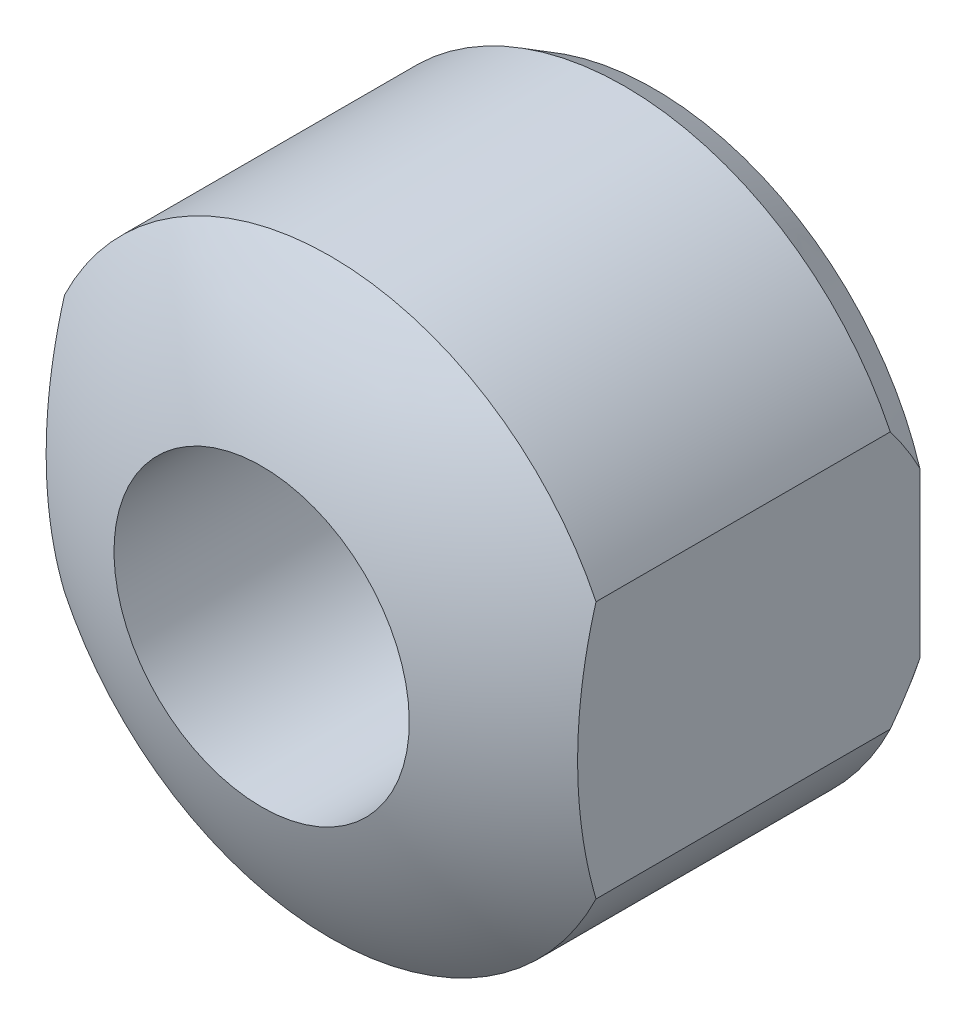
ISO-10303-21;
HEADER;
FILE_DESCRIPTION(('STEP AP214'),'2;1');
FILE_NAME('part.step','',(''),(''),'','','');
FILE_SCHEMA(('AUTOMOTIVE_DESIGN { 1 0 10303 214 1 1 1 1 }'));
ENDSEC;
DATA;
#1=APPLICATION_CONTEXT('core data for automotive mechanical design processes');
#2=APPLICATION_PROTOCOL_DEFINITION('international standard','automotive_design',2000,#1);
#3=PRODUCT_CONTEXT('',#1,'mechanical');
#4=PRODUCT('Part','Part','',(#3));
#5=PRODUCT_RELATED_PRODUCT_CATEGORY('part','',(#4));
#6=PRODUCT_DEFINITION_FORMATION('','',#4);
#7=PRODUCT_DEFINITION_CONTEXT('part definition',#1,'design');
#8=PRODUCT_DEFINITION('design','',#6,#7);
#9=PRODUCT_DEFINITION_SHAPE('','',#8);
#10=(LENGTH_UNIT() NAMED_UNIT(*) SI_UNIT(.MILLI.,.METRE.));
#11=(NAMED_UNIT(*) PLANE_ANGLE_UNIT() SI_UNIT($,.RADIAN.));
#12=(NAMED_UNIT(*) SI_UNIT($,.STERADIAN.) SOLID_ANGLE_UNIT());
#13=UNCERTAINTY_MEASURE_WITH_UNIT(LENGTH_MEASURE(1.E-05),#10,'distance_accuracy_value','');
#14=(GEOMETRIC_REPRESENTATION_CONTEXT(3) GLOBAL_UNCERTAINTY_ASSIGNED_CONTEXT((#13)) GLOBAL_UNIT_ASSIGNED_CONTEXT((#10,
#11,#12)) REPRESENTATION_CONTEXT('',''));
#15=CARTESIAN_POINT('',(0.,0.,0.));
#16=DIRECTION('',(0.,0.,1.));
#17=DIRECTION('',(1.,0.,0.));
#18=AXIS2_PLACEMENT_3D('',#15,#16,#17);
#19=CARTESIAN_POINT('',(4.6750797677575E-13,0.,-2.00000000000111));
#20=DIRECTION('',(0.,0.,1.));
#21=DIRECTION('',(-1.,0.,0.));
#22=AXIS2_PLACEMENT_3D('',#19,#20,#21);
#23=SPHERICAL_SURFACE('',#22,9.0000000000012);
#24=CARTESIAN_POINT('',(4.5,0.,-2.00000000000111));
#25=DIRECTION('',(-1.,0.,0.));
#26=DIRECTION('',(0.,-1.,0.));
#27=AXIS2_PLACEMENT_3D('',#24,#25,#26);
#28=CIRCLE('',#27,7.7942286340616);
#29=CARTESIAN_POINT('',(4.5,2.17944947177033,5.4833147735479));
#30=VERTEX_POINT('',#29);
#31=CARTESIAN_POINT('',(4.5,-2.17944947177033,5.4833147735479));
#32=VERTEX_POINT('',#31);
#33=EDGE_CURVE('E109',#30,#32,#28,.F.);
#34=ORIENTED_EDGE('',*,*,#33,.F.);
#35=CARTESIAN_POINT('',(0.,0.,5.4833147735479));
#36=DIRECTION('',(0.,0.,1.));
#37=DIRECTION('',(0.,1.,0.));
#38=AXIS2_PLACEMENT_3D('',#35,#36,#37);
#39=CIRCLE('',#38,5.);
#40=CARTESIAN_POINT('',(-4.5,2.17944947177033,5.4833147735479));
#41=VERTEX_POINT('',#40);
#42=EDGE_CURVE('E21',#30,#41,#39,.T.);
#43=ORIENTED_EDGE('',*,*,#42,.T.);
#44=CARTESIAN_POINT('',(-4.5,0.,-2.00000000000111));
#45=DIRECTION('',(1.,0.,0.));
#46=DIRECTION('',(0.,1.,0.));
#47=AXIS2_PLACEMENT_3D('',#44,#45,#46);
#48=CIRCLE('',#47,7.79422863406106);
#49=CARTESIAN_POINT('',(-4.5,-2.17944947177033,5.4833147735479));
#50=VERTEX_POINT('',#49);
#51=EDGE_CURVE('E91',#50,#41,#48,.F.);
#52=ORIENTED_EDGE('',*,*,#51,.F.);
#53=EDGE_CURVE('E9',#50,#32,#39,.T.);
#54=ORIENTED_EDGE('',*,*,#53,.T.);
#55=EDGE_LOOP('',(#34,#43,#52,#54));
#56=FACE_BOUND('',#55,.T.);
#57=CARTESIAN_POINT('',(0.,0.,6.64580823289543));
#58=DIRECTION('',(0.,0.,-1.));
#59=DIRECTION('',(0.,-1.,0.));
#60=AXIS2_PLACEMENT_3D('',#57,#58,#59);
#61=CIRCLE('',#60,2.5);
#62=CARTESIAN_POINT('',(0.,-2.5,6.64580823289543));
#63=VERTEX_POINT('',#62);
#64=EDGE_CURVE('E85',#63,#63,#61,.T.);
#65=ORIENTED_EDGE('',*,*,#64,.T.);
#66=EDGE_LOOP('',(#65));
#67=FACE_BOUND('',#66,.T.);
#68=ADVANCED_FACE('F14',(#56,#67),#23,.T.);
#69=CARTESIAN_POINT('',(0.,0.,0.));
#70=DIRECTION('',(0.,0.,1.));
#71=DIRECTION('',(0.,1.,0.));
#72=AXIS2_PLACEMENT_3D('',#69,#70,#71);
#73=CYLINDRICAL_SURFACE('',#72,5.);
#74=ORIENTED_EDGE('',*,*,#42,.F.);
#75=DIRECTION('',(0.,0.,1.));
#76=VECTOR('',#75,1.);
#77=CARTESIAN_POINT('',(4.5,2.17944947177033,0.));
#78=LINE('',#77,#76);
#79=CARTESIAN_POINT('',(4.5,2.17944947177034,0.5));
#80=VERTEX_POINT('',#79);
#81=EDGE_CURVE('E76',#30,#80,#78,.F.);
#82=ORIENTED_EDGE('',*,*,#81,.T.);
#83=CARTESIAN_POINT('',(0.,0.,0.5));
#84=DIRECTION('',(0.,0.,1.));
#85=DIRECTION('',(0.,1.,0.));
#86=AXIS2_PLACEMENT_3D('',#83,#84,#85);
#87=CIRCLE('',#86,5.);
#88=CARTESIAN_POINT('',(-4.5,2.17944947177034,0.5));
#89=VERTEX_POINT('',#88);
#90=EDGE_CURVE('E84',#80,#89,#87,.T.);
#91=ORIENTED_EDGE('',*,*,#90,.T.);
#92=DIRECTION('',(0.,0.,1.));
#93=VECTOR('',#92,1.);
#94=CARTESIAN_POINT('',(-4.5,2.17944947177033,0.));
#95=LINE('',#94,#93);
#96=EDGE_CURVE('E105',#89,#41,#95,.T.);
#97=ORIENTED_EDGE('',*,*,#96,.T.);
#98=EDGE_LOOP('',(#74,#82,#91,#97));
#99=FACE_BOUND('',#98,.T.);
#100=ADVANCED_FACE('F104',(#99),#73,.T.);
#101=CARTESIAN_POINT('',(0.,0.,0.5));
#102=DIRECTION('',(0.,0.,1.));
#103=DIRECTION('',(0.,1.,0.));
#104=AXIS2_PLACEMENT_3D('',#101,#102,#103);
#105=CONICAL_SURFACE('',#104,5.,0.523598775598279);
#106=ORIENTED_EDGE('',*,*,#90,.F.);
#107=CARTESIAN_POINT('',(4.5,5.0188098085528,3.5151626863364));
#108=CARTESIAN_POINT('',(4.5,4.90794191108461,3.37222700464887));
#109=CARTESIAN_POINT('',(4.5,4.79608084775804,3.23004881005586));
#110=CARTESIAN_POINT('',(4.5,4.56991738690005,2.94757122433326));
#111=CARTESIAN_POINT('',(4.5,4.45561418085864,2.80727248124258));
#112=CARTESIAN_POINT('',(4.5,4.22260911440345,2.52711902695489));
#113=CARTESIAN_POINT('',(4.5,4.10386854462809,2.38729640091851));
#114=CARTESIAN_POINT('',(4.5,3.86293020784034,2.11068843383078));
#115=CARTESIAN_POINT('',(4.5,3.74073294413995,1.97390265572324));
#116=CARTESIAN_POINT('',(4.5,3.48308543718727,1.6943486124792));
#117=CARTESIAN_POINT('',(4.5,3.34731834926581,1.55187082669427));
#118=CARTESIAN_POINT('',(4.5,3.06974114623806,1.27274992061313));
#119=CARTESIAN_POINT('',(4.5,2.92792833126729,1.13610946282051));
#120=CARTESIAN_POINT('',(4.5,2.63769738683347,0.871736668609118));
#121=CARTESIAN_POINT('',(4.5,2.48932292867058,0.743956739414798));
#122=CARTESIAN_POINT('',(4.5,2.18349580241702,0.499865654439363));
#123=CARTESIAN_POINT('',(4.5,2.02605405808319,0.383541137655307));
#124=CARTESIAN_POINT('',(4.5,1.78663625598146,0.22493208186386));
#125=CARTESIAN_POINT('',(4.5,1.70897444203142,0.176128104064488));
#126=CARTESIAN_POINT('',(4.5,1.55098989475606,0.0829326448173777));
#127=CARTESIAN_POINT('',(4.5,1.47066620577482,0.0385427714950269));
#128=CARTESIAN_POINT('',(4.5,1.30784299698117,-0.0446296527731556));
#129=CARTESIAN_POINT('',(4.5,1.22536247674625,-0.0834490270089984));
#130=CARTESIAN_POINT('',(4.5,1.05776162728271,-0.154833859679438));
#131=CARTESIAN_POINT('',(4.5,0.972641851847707,-0.187400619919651));
#132=CARTESIAN_POINT('',(4.5,0.739201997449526,-0.265504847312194));
#133=CARTESIAN_POINT('',(4.5,0.588437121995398,-0.304113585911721));
#134=CARTESIAN_POINT('',(4.5,0.282539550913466,-0.355110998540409));
#135=CARTESIAN_POINT('',(4.5,0.127411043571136,-0.367524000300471));
#136=CARTESIAN_POINT('',(4.5,-0.182772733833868,-0.364231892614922));
#137=CARTESIAN_POINT('',(4.5,-0.337827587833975,-0.348486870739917));
#138=CARTESIAN_POINT('',(4.5,-0.643120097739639,-0.291243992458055));
#139=CARTESIAN_POINT('',(4.5,-0.793349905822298,-0.249706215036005));
#140=CARTESIAN_POINT('',(4.5,-1.15880598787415,-0.12033487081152));
#141=CARTESIAN_POINT('',(4.5,-1.36945500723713,-0.0197663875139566));
#142=CARTESIAN_POINT('',(4.5,-1.67256417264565,0.153280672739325));
#143=CARTESIAN_POINT('',(4.5,-1.77173834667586,0.21488362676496));
#144=CARTESIAN_POINT('',(4.5,-1.96614271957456,0.344041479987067));
#145=CARTESIAN_POINT('',(4.5,-2.06137380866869,0.411595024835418));
#146=CARTESIAN_POINT('',(4.5,-2.30741799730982,0.595629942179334));
#147=CARTESIAN_POINT('',(4.5,-2.45528404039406,0.716030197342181));
#148=CARTESIAN_POINT('',(4.5,-2.67036058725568,0.902373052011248));
#149=CARTESIAN_POINT('',(4.5,-2.74049583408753,0.965017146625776));
#150=CARTESIAN_POINT('',(4.5,-2.87905632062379,1.0921269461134));
#151=CARTESIAN_POINT('',(4.5,-2.94748210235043,1.15659205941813));
#152=CARTESIAN_POINT('',(4.5,-3.01516268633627,1.22183624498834));
#153=B_SPLINE_CURVE_WITH_KNOTS('',3,(#107,#108,#109,#110,#111,#112,#113,#114,#115,#116,#117,
#118,#119,#120,#121,#122,#123,#124,#125,#126,#127,#128,#129,#130,#131,#132,#133,#134,#135,#136,
#137,#138,#139,#140,#141,#142,#143,#144,#145,#146,#147,#148,#149,#150,#151,#152),.UNSPECIFIED.,
.F.,.F.,(4,2,2,2,2,2,2,2,2,2,2,2,2,2,2,2,2,2,2,2,2,2,4),(0.,0.542689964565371,1.08556246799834,
1.63583034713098,2.1860185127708,2.7763022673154,3.36685244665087,3.95393526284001,
4.54032501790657,4.81537958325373,5.09053399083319,5.36377626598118,5.6369615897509,
6.10179897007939,6.56620447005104,7.03126876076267,7.49705466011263,8.19307286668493,
8.54321858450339,8.89328481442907,9.46479429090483,9.74688878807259,10.0288926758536),.UNSPECIFIED.);
#154=CARTESIAN_POINT('',(4.5,1.39519962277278,0.));
#155=VERTEX_POINT('',#154);
#156=EDGE_CURVE('E68',#80,#155,#153,.T.);
#157=ORIENTED_EDGE('',*,*,#156,.T.);
#158=CARTESIAN_POINT('',(0.,0.,0.));
#159=DIRECTION('',(0.,0.,1.));
#160=DIRECTION('',(0.,1.,0.));
#161=AXIS2_PLACEMENT_3D('',#158,#159,#160);
#162=CIRCLE('',#161,4.7113248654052);
#163=CARTESIAN_POINT('',(-4.5,1.39519962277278,0.));
#164=VERTEX_POINT('',#163);
#165=EDGE_CURVE('E82',#155,#164,#162,.T.);
#166=ORIENTED_EDGE('',*,*,#165,.T.);
#167=CARTESIAN_POINT('',(-4.5,-3.01516268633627,1.22183624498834));
#168=CARTESIAN_POINT('',(-4.5,-2.95586660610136,1.16467332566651));
#169=CARTESIAN_POINT('',(-4.5,-2.89599591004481,1.10810789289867));
#170=CARTESIAN_POINT('',(-4.5,-2.77496213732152,0.996347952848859));
#171=CARTESIAN_POINT('',(-4.5,-2.7137987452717,0.941153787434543));
#172=CARTESIAN_POINT('',(-4.5,-2.52757348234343,0.777384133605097));
#173=CARTESIAN_POINT('',(-4.5,-2.40037352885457,0.671203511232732));
#174=CARTESIAN_POINT('',(-4.5,-2.13536694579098,0.464484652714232));
#175=CARTESIAN_POINT('',(-4.5,-1.9973588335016,0.364202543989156));
#176=CARTESIAN_POINT('',(-4.5,-1.71305567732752,0.176532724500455));
#177=CARTESIAN_POINT('',(-4.5,-1.56677990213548,0.0891166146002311));
#178=CARTESIAN_POINT('',(-4.5,-1.34171213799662,-0.0278732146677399));
#179=CARTESIAN_POINT('',(-4.5,-1.2664453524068,-0.0642495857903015));
#180=CARTESIAN_POINT('',(-4.5,-1.11363024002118,-0.131920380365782));
#181=CARTESIAN_POINT('',(-4.5,-1.03608171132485,-0.163214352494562));
#182=CARTESIAN_POINT('',(-4.5,-0.879373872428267,-0.219699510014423));
#183=CARTESIAN_POINT('',(-4.5,-0.800229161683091,-0.244930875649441));
#184=CARTESIAN_POINT('',(-4.5,-0.640126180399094,-0.288751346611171));
#185=CARTESIAN_POINT('',(-4.5,-0.559168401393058,-0.307342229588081));
#186=CARTESIAN_POINT('',(-4.5,-0.394736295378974,-0.337394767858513));
#187=CARTESIAN_POINT('',(-4.5,-0.311242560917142,-0.348751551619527));
#188=CARTESIAN_POINT('',(-4.5,-0.143547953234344,-0.363409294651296));
#189=CARTESIAN_POINT('',(-4.5,-0.0593471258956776,-0.366710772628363));
#190=CARTESIAN_POINT('',(-4.5,0.109037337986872,-0.365102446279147));
#191=CARTESIAN_POINT('',(-4.5,0.193220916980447,-0.360186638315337));
#192=CARTESIAN_POINT('',(-4.5,0.36073493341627,-0.342363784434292));
#193=CARTESIAN_POINT('',(-4.5,0.444065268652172,-0.329455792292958));
#194=CARTESIAN_POINT('',(-4.5,0.618485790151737,-0.294339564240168));
#195=CARTESIAN_POINT('',(-4.5,0.709397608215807,-0.271250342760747));
#196=CARTESIAN_POINT('',(-4.5,0.888766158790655,-0.216936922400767));
#197=CARTESIAN_POINT('',(-4.5,0.977221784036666,-0.185709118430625));
#198=CARTESIAN_POINT('',(-4.5,1.15154953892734,-0.116215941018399));
#199=CARTESIAN_POINT('',(-4.5,1.23741474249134,-0.077933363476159));
#200=CARTESIAN_POINT('',(-4.5,1.40625691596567,0.0044865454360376));
#201=CARTESIAN_POINT('',(-4.5,1.48923397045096,0.0486237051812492));
#202=CARTESIAN_POINT('',(-4.5,1.66628172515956,0.149685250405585));
#203=CARTESIAN_POINT('',(-4.5,1.75983754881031,0.207507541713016));
#204=CARTESIAN_POINT('',(-4.5,1.94342924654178,0.328512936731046));
#205=CARTESIAN_POINT('',(-4.5,2.03346377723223,0.391698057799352));
#206=CARTESIAN_POINT('',(-4.5,2.29904677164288,0.587860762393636));
#207=CARTESIAN_POINT('',(-4.5,2.46982294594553,0.727295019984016));
#208=CARTESIAN_POINT('',(-4.5,2.80246842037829,1.01849615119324));
#209=CARTESIAN_POINT('',(-4.5,2.96426414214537,1.17034513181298));
#210=CARTESIAN_POINT('',(-4.5,3.27980281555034,1.48189346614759));
#211=CARTESIAN_POINT('',(-4.5,3.43355209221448,1.64158645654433));
#212=CARTESIAN_POINT('',(-4.5,3.71188510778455,1.94194570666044));
#213=CARTESIAN_POINT('',(-4.5,3.8373453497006,2.08180703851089));
#214=CARTESIAN_POINT('',(-4.5,4.08460412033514,2.36477062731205));
#215=CARTESIAN_POINT('',(-4.5,4.20640193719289,2.50787350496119));
#216=CARTESIAN_POINT('',(-4.5,4.44470162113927,2.79393957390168));
#217=CARTESIAN_POINT('',(-4.5,4.56125983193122,2.93685601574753));
#218=CARTESIAN_POINT('',(-4.5,4.79182460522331,3.22464127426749));
#219=CARTESIAN_POINT('',(-4.5,4.90583216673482,3.36950928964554));
#220=CARTESIAN_POINT('',(-4.5,5.01880980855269,3.51516268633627));
#221=B_SPLINE_CURVE_WITH_KNOTS('',3,(#167,#168,#169,#170,#171,#172,#173,#174,#175,#176,#177,
#178,#179,#180,#181,#182,#183,#184,#185,#186,#187,#188,#189,#190,#191,#192,#193,#194,#195,#196,
#197,#198,#199,#200,#201,#202,#203,#204,#205,#206,#207,#208,#209,#210,#211,#212,#213,#214,#215,
#216,#217,#218,#219,#220),.UNSPECIFIED.,.F.,.F.,(4,2,2,2,2,2,2,2,2,2,2,2,2,2,2,2,2,2,2,2,2,2,2,
2,2,2,4),(0.,0.24707929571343,0.49421958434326,0.990998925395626,1.50231926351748,
2.01249346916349,2.26313207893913,2.51379293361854,2.7627436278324,3.01162762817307,
3.26404213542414,3.51644038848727,3.76902312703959,4.02163577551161,4.30259136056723,
4.58367161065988,4.86544661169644,5.14721335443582,5.47692582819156,5.80676288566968,
6.46731276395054,7.1326532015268,7.79746253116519,8.36105342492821,8.92475316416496,
9.47798553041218,10.030997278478),.UNSPECIFIED.);
#222=EDGE_CURVE('E107',#164,#89,#221,.T.);
#223=ORIENTED_EDGE('',*,*,#222,.T.);
#224=EDGE_LOOP('',(#106,#157,#166,#223));
#225=FACE_BOUND('',#224,.T.);
#226=ADVANCED_FACE('F80',(#225),#105,.T.);
#227=CARTESIAN_POINT('',(-4.7113248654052,0.,0.));
#228=DIRECTION('',(0.,0.,-1.));
#229=DIRECTION('',(0.,-1.,0.));
#230=AXIS2_PLACEMENT_3D('',#227,#228,#229);
#231=PLANE('',#230);
#232=CARTESIAN_POINT('',(0.,0.,0.));
#233=DIRECTION('',(0.,0.,1.));
#234=DIRECTION('',(0.,1.,0.));
#235=AXIS2_PLACEMENT_3D('',#232,#233,#234);
#236=CIRCLE('',#235,2.5);
#237=CARTESIAN_POINT('',(0.,2.5,0.));
#238=VERTEX_POINT('',#237);
#239=EDGE_CURVE('E154',#238,#238,#236,.T.);
#240=ORIENTED_EDGE('',*,*,#239,.T.);
#241=EDGE_LOOP('',(#240));
#242=FACE_BOUND('',#241,.T.);
#243=ORIENTED_EDGE('',*,*,#165,.F.);
#244=DIRECTION('',(0.,1.,0.));
#245=VECTOR('',#244,1.);
#246=CARTESIAN_POINT('',(4.5,-5.,0.));
#247=LINE('',#246,#245);
#248=CARTESIAN_POINT('',(4.5,-1.39519962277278,0.));
#249=VERTEX_POINT('',#248);
#250=EDGE_CURVE('E64',#249,#155,#247,.T.);
#251=ORIENTED_EDGE('',*,*,#250,.F.);
#252=CARTESIAN_POINT('',(-4.5,-1.39519962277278,0.));
#253=VERTEX_POINT('',#252);
#254=EDGE_CURVE('E90',#253,#249,#162,.T.);
#255=ORIENTED_EDGE('',*,*,#254,.F.);
#256=DIRECTION('',(0.,1.,0.));
#257=VECTOR('',#256,1.);
#258=CARTESIAN_POINT('',(-4.5,-5.,0.));
#259=LINE('',#258,#257);
#260=EDGE_CURVE('E88',#253,#164,#259,.T.);
#261=ORIENTED_EDGE('',*,*,#260,.T.);
#262=EDGE_LOOP('',(#243,#251,#255,#261));
#263=FACE_BOUND('',#262,.T.);
#264=ADVANCED_FACE('F87',(#242,#263),#231,.T.);
#265=DIRECTION('',(0.,0.,1.));
#266=VECTOR('',#265,1.);
#267=CARTESIAN_POINT('',(4.5,-2.17944947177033,0.));
#268=LINE('',#267,#266);
#269=CARTESIAN_POINT('',(4.5,-2.17944947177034,0.5));
#270=VERTEX_POINT('',#269);
#271=EDGE_CURVE('E111',#32,#270,#268,.F.);
#272=ORIENTED_EDGE('',*,*,#271,.F.);
#273=ORIENTED_EDGE('',*,*,#53,.F.);
#274=DIRECTION('',(0.,0.,1.));
#275=VECTOR('',#274,1.);
#276=CARTESIAN_POINT('',(-4.5,-2.17944947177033,0.));
#277=LINE('',#276,#275);
#278=CARTESIAN_POINT('',(-4.5,-2.17944947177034,0.5));
#279=VERTEX_POINT('',#278);
#280=EDGE_CURVE('E28',#279,#50,#277,.T.);
#281=ORIENTED_EDGE('',*,*,#280,.F.);
#282=EDGE_CURVE('E95',#279,#270,#87,.T.);
#283=ORIENTED_EDGE('',*,*,#282,.T.);
#284=EDGE_LOOP('',(#272,#273,#281,#283));
#285=FACE_BOUND('',#284,.T.);
#286=ADVANCED_FACE('F137',(#285),#73,.T.);
#287=CARTESIAN_POINT('',(4.5,-5.0188098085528,3.5151626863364));
#288=CARTESIAN_POINT('',(4.5,-4.90794191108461,3.37222700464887));
#289=CARTESIAN_POINT('',(4.5,-4.79608084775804,3.23004881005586));
#290=CARTESIAN_POINT('',(4.5,-4.56991738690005,2.94757122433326));
#291=CARTESIAN_POINT('',(4.5,-4.45561418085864,2.80727248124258));
#292=CARTESIAN_POINT('',(4.5,-4.22260911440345,2.52711902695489));
#293=CARTESIAN_POINT('',(4.5,-4.10386854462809,2.38729640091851));
#294=CARTESIAN_POINT('',(4.5,-3.86293020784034,2.11068843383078));
#295=CARTESIAN_POINT('',(4.5,-3.74073294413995,1.97390265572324));
#296=CARTESIAN_POINT('',(4.5,-3.48308543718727,1.6943486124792));
#297=CARTESIAN_POINT('',(4.5,-3.34731834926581,1.55187082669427));
#298=CARTESIAN_POINT('',(4.5,-3.06974114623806,1.27274992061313));
#299=CARTESIAN_POINT('',(4.5,-2.92792833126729,1.13610946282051));
#300=CARTESIAN_POINT('',(4.5,-2.63769738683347,0.871736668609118));
#301=CARTESIAN_POINT('',(4.5,-2.48932292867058,0.743956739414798));
#302=CARTESIAN_POINT('',(4.5,-2.18349580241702,0.499865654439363));
#303=CARTESIAN_POINT('',(4.5,-2.02605405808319,0.383541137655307));
#304=CARTESIAN_POINT('',(4.5,-1.78663625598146,0.22493208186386));
#305=CARTESIAN_POINT('',(4.5,-1.70897444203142,0.176128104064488));
#306=CARTESIAN_POINT('',(4.5,-1.55098989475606,0.0829326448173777));
#307=CARTESIAN_POINT('',(4.5,-1.47066620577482,0.0385427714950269));
#308=CARTESIAN_POINT('',(4.5,-1.30784299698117,-0.0446296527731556));
#309=CARTESIAN_POINT('',(4.5,-1.22536247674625,-0.0834490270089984));
#310=CARTESIAN_POINT('',(4.5,-1.05776162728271,-0.154833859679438));
#311=CARTESIAN_POINT('',(4.5,-0.972641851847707,-0.187400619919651));
#312=CARTESIAN_POINT('',(4.5,-0.739201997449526,-0.265504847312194));
#313=CARTESIAN_POINT('',(4.5,-0.588437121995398,-0.304113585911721));
#314=CARTESIAN_POINT('',(4.5,-0.282539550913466,-0.355110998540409));
#315=CARTESIAN_POINT('',(4.5,-0.127411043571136,-0.367524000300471));
#316=CARTESIAN_POINT('',(4.5,0.182772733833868,-0.364231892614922));
#317=CARTESIAN_POINT('',(4.5,0.337827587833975,-0.348486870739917));
#318=CARTESIAN_POINT('',(4.5,0.643120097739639,-0.291243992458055));
#319=CARTESIAN_POINT('',(4.5,0.793349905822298,-0.249706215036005));
#320=CARTESIAN_POINT('',(4.5,1.15880598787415,-0.12033487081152));
#321=CARTESIAN_POINT('',(4.5,1.36945500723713,-0.0197663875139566));
#322=CARTESIAN_POINT('',(4.5,1.67256417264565,0.153280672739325));
#323=CARTESIAN_POINT('',(4.5,1.77173834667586,0.21488362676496));
#324=CARTESIAN_POINT('',(4.5,1.96614271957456,0.344041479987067));
#325=CARTESIAN_POINT('',(4.5,2.06137380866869,0.411595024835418));
#326=CARTESIAN_POINT('',(4.5,2.30741799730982,0.595629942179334));
#327=CARTESIAN_POINT('',(4.5,2.45528404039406,0.716030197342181));
#328=CARTESIAN_POINT('',(4.5,2.67036058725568,0.902373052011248));
#329=CARTESIAN_POINT('',(4.5,2.74049583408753,0.965017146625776));
#330=CARTESIAN_POINT('',(4.5,2.87905632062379,1.0921269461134));
#331=CARTESIAN_POINT('',(4.5,2.94748210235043,1.15659205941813));
#332=CARTESIAN_POINT('',(4.5,3.01516268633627,1.22183624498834));
#333=B_SPLINE_CURVE_WITH_KNOTS('',3,(#287,#288,#289,#290,#291,#292,#293,#294,#295,#296,#297,
#298,#299,#300,#301,#302,#303,#304,#305,#306,#307,#308,#309,#310,#311,#312,#313,#314,#315,#316,
#317,#318,#319,#320,#321,#322,#323,#324,#325,#326,#327,#328,#329,#330,#331,#332),.UNSPECIFIED.,
.F.,.F.,(4,2,2,2,2,2,2,2,2,2,2,2,2,2,2,2,2,2,2,2,2,2,4),(0.,0.542689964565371,1.08556246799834,
1.63583034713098,2.1860185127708,2.7763022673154,3.36685244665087,3.95393526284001,
4.54032501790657,4.81537958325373,5.09053399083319,5.36377626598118,5.6369615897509,
6.10179897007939,6.56620447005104,7.03126876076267,7.49705466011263,8.19307286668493,
8.54321858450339,8.89328481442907,9.46479429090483,9.74688878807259,10.0288926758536),.UNSPECIFIED.);
#334=EDGE_CURVE('E71',#270,#249,#333,.T.);
#335=ORIENTED_EDGE('',*,*,#334,.F.);
#336=ORIENTED_EDGE('',*,*,#282,.F.);
#337=CARTESIAN_POINT('',(-4.5,3.01516268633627,1.22183624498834));
#338=CARTESIAN_POINT('',(-4.5,2.95586660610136,1.16467332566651));
#339=CARTESIAN_POINT('',(-4.5,2.89599591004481,1.10810789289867));
#340=CARTESIAN_POINT('',(-4.5,2.77496213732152,0.996347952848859));
#341=CARTESIAN_POINT('',(-4.5,2.7137987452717,0.941153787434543));
#342=CARTESIAN_POINT('',(-4.5,2.52757348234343,0.777384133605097));
#343=CARTESIAN_POINT('',(-4.5,2.40037352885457,0.671203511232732));
#344=CARTESIAN_POINT('',(-4.5,2.13536694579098,0.464484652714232));
#345=CARTESIAN_POINT('',(-4.5,1.9973588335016,0.364202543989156));
#346=CARTESIAN_POINT('',(-4.5,1.71305567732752,0.176532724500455));
#347=CARTESIAN_POINT('',(-4.5,1.56677990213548,0.0891166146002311));
#348=CARTESIAN_POINT('',(-4.5,1.34171213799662,-0.0278732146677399));
#349=CARTESIAN_POINT('',(-4.5,1.2664453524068,-0.0642495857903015));
#350=CARTESIAN_POINT('',(-4.5,1.11363024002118,-0.131920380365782));
#351=CARTESIAN_POINT('',(-4.5,1.03608171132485,-0.163214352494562));
#352=CARTESIAN_POINT('',(-4.5,0.879373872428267,-0.219699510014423));
#353=CARTESIAN_POINT('',(-4.5,0.800229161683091,-0.244930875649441));
#354=CARTESIAN_POINT('',(-4.5,0.640126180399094,-0.288751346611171));
#355=CARTESIAN_POINT('',(-4.5,0.559168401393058,-0.307342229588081));
#356=CARTESIAN_POINT('',(-4.5,0.394736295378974,-0.337394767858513));
#357=CARTESIAN_POINT('',(-4.5,0.311242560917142,-0.348751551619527));
#358=CARTESIAN_POINT('',(-4.5,0.143547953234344,-0.363409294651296));
#359=CARTESIAN_POINT('',(-4.5,0.0593471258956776,-0.366710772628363));
#360=CARTESIAN_POINT('',(-4.5,-0.109037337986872,-0.365102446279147));
#361=CARTESIAN_POINT('',(-4.5,-0.193220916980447,-0.360186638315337));
#362=CARTESIAN_POINT('',(-4.5,-0.36073493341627,-0.342363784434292));
#363=CARTESIAN_POINT('',(-4.5,-0.444065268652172,-0.329455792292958));
#364=CARTESIAN_POINT('',(-4.5,-0.618485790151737,-0.294339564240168));
#365=CARTESIAN_POINT('',(-4.5,-0.709397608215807,-0.271250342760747));
#366=CARTESIAN_POINT('',(-4.5,-0.888766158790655,-0.216936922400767));
#367=CARTESIAN_POINT('',(-4.5,-0.977221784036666,-0.185709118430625));
#368=CARTESIAN_POINT('',(-4.5,-1.15154953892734,-0.116215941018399));
#369=CARTESIAN_POINT('',(-4.5,-1.23741474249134,-0.077933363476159));
#370=CARTESIAN_POINT('',(-4.5,-1.40625691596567,0.00448654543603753));
#371=CARTESIAN_POINT('',(-4.5,-1.48923397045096,0.0486237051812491));
#372=CARTESIAN_POINT('',(-4.5,-1.66628172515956,0.149685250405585));
#373=CARTESIAN_POINT('',(-4.5,-1.75983754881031,0.207507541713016));
#374=CARTESIAN_POINT('',(-4.5,-1.94342924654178,0.328512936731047));
#375=CARTESIAN_POINT('',(-4.5,-2.03346377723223,0.391698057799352));
#376=CARTESIAN_POINT('',(-4.5,-2.29904677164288,0.587860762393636));
#377=CARTESIAN_POINT('',(-4.5,-2.46982294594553,0.727295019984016));
#378=CARTESIAN_POINT('',(-4.5,-2.80246842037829,1.01849615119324));
#379=CARTESIAN_POINT('',(-4.5,-2.96426414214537,1.17034513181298));
#380=CARTESIAN_POINT('',(-4.5,-3.27980281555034,1.48189346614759));
#381=CARTESIAN_POINT('',(-4.5,-3.43355209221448,1.64158645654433));
#382=CARTESIAN_POINT('',(-4.5,-3.71188510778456,1.94194570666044));
#383=CARTESIAN_POINT('',(-4.5,-3.8373453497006,2.08180703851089));
#384=CARTESIAN_POINT('',(-4.5,-4.08460412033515,2.36477062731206));
#385=CARTESIAN_POINT('',(-4.5,-4.2064019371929,2.5078735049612));
#386=CARTESIAN_POINT('',(-4.5,-4.44470162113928,2.79393957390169));
#387=CARTESIAN_POINT('',(-4.5,-4.56125983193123,2.93685601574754));
#388=CARTESIAN_POINT('',(-4.5,-4.79182460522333,3.2246412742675));
#389=CARTESIAN_POINT('',(-4.5,-4.90583216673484,3.36950928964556));
#390=CARTESIAN_POINT('',(-4.5,-5.01880980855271,3.51516268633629));
#391=B_SPLINE_CURVE_WITH_KNOTS('',3,(#337,#338,#339,#340,#341,#342,#343,#344,#345,#346,#347,
#348,#349,#350,#351,#352,#353,#354,#355,#356,#357,#358,#359,#360,#361,#362,#363,#364,#365,#366,
#367,#368,#369,#370,#371,#372,#373,#374,#375,#376,#377,#378,#379,#380,#381,#382,#383,#384,#385,
#386,#387,#388,#389,#390),.UNSPECIFIED.,.F.,.F.,(4,2,2,2,2,2,2,2,2,2,2,2,2,2,2,2,2,2,2,2,2,2,2,
2,2,2,4),(0.,0.24707929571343,0.49421958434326,0.990998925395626,1.50231926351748,
2.01249346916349,2.26313207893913,2.51379293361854,2.7627436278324,3.01162762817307,
3.26404213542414,3.51644038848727,3.76902312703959,4.02163577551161,4.30259136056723,
4.58367161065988,4.86544661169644,5.14721335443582,5.47692582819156,5.80676288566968,
6.46731276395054,7.1326532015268,7.79746253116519,8.36105342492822,8.92475316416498,
9.4779855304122,10.030997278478),.UNSPECIFIED.);
#392=EDGE_CURVE('E33',#253,#279,#391,.T.);
#393=ORIENTED_EDGE('',*,*,#392,.F.);
#394=ORIENTED_EDGE('',*,*,#254,.T.);
#395=EDGE_LOOP('',(#335,#336,#393,#394));
#396=FACE_BOUND('',#395,.T.);
#397=ADVANCED_FACE('F130',(#396),#105,.T.);
#398=CARTESIAN_POINT('',(-4.5,-5.,6.7));
#399=DIRECTION('',(1.,0.,0.));
#400=DIRECTION('',(0.,1.,0.));
#401=AXIS2_PLACEMENT_3D('',#398,#399,#400);
#402=PLANE('',#401);
#403=ORIENTED_EDGE('',*,*,#51,.T.);
#404=ORIENTED_EDGE('',*,*,#96,.F.);
#405=ORIENTED_EDGE('',*,*,#222,.F.);
#406=ORIENTED_EDGE('',*,*,#260,.F.);
#407=ORIENTED_EDGE('',*,*,#392,.T.);
#408=ORIENTED_EDGE('',*,*,#280,.T.);
#409=EDGE_LOOP('',(#403,#404,#405,#406,#407,#408));
#410=FACE_BOUND('',#409,.T.);
#411=ADVANCED_FACE('F106',(#410),#402,.F.);
#412=CARTESIAN_POINT('',(4.5,-5.,0.));
#413=DIRECTION('',(-1.,0.,0.));
#414=DIRECTION('',(0.,-1.,0.));
#415=AXIS2_PLACEMENT_3D('',#412,#413,#414);
#416=PLANE('',#415);
#417=ORIENTED_EDGE('',*,*,#33,.T.);
#418=ORIENTED_EDGE('',*,*,#271,.T.);
#419=ORIENTED_EDGE('',*,*,#334,.T.);
#420=ORIENTED_EDGE('',*,*,#250,.T.);
#421=ORIENTED_EDGE('',*,*,#156,.F.);
#422=ORIENTED_EDGE('',*,*,#81,.F.);
#423=EDGE_LOOP('',(#417,#418,#419,#420,#421,#422));
#424=FACE_BOUND('',#423,.T.);
#425=ADVANCED_FACE('F66',(#424),#416,.F.);
#426=CARTESIAN_POINT('',(0.,0.,6.65787729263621));
#427=DIRECTION('',(0.,0.,-1.));
#428=DIRECTION('',(0.,-1.,0.));
#429=AXIS2_PLACEMENT_3D('',#426,#427,#428);
#430=CYLINDRICAL_SURFACE('',#429,2.5);
#431=ORIENTED_EDGE('',*,*,#64,.F.);
#432=EDGE_LOOP('',(#431));
#433=FACE_BOUND('',#432,.T.);
#434=ORIENTED_EDGE('',*,*,#239,.F.);
#435=EDGE_LOOP('',(#434));
#436=FACE_BOUND('',#435,.T.);
#437=ADVANCED_FACE('F164',(#433,#436),#430,.F.);
#438=CLOSED_SHELL('',(#68,#100,#226,#264,#286,#397,#411,#425,#437));
#439=MANIFOLD_SOLID_BREP('B1',#438);
#440=ADVANCED_BREP_SHAPE_REPRESENTATION('',(#18,#439),#14);
#441=SHAPE_DEFINITION_REPRESENTATION(#9,#440);
ENDSEC;
END-ISO-10303-21;
